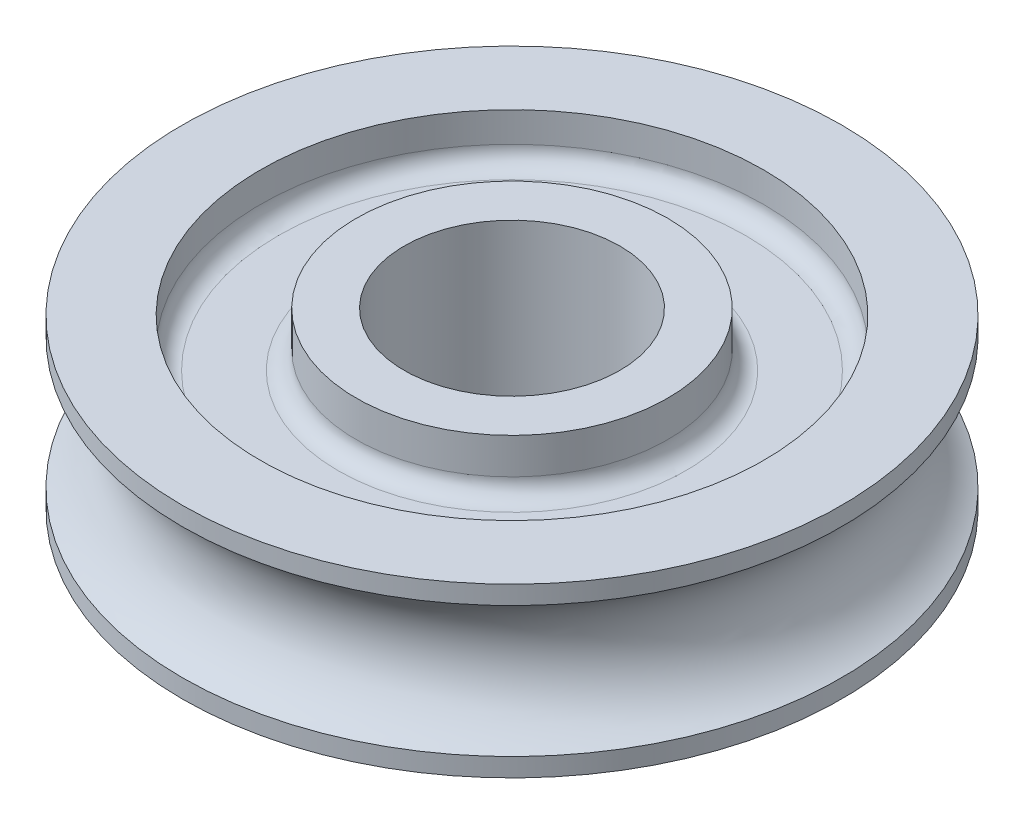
ISO-10303-21;
HEADER;
FILE_DESCRIPTION(('STEP AP214'),'2;1');
FILE_NAME('part.step','',(''),(''),'','','');
FILE_SCHEMA(('AUTOMOTIVE_DESIGN { 1 0 10303 214 1 1 1 1 }'));
ENDSEC;
DATA;
#1=APPLICATION_CONTEXT('core data for automotive mechanical design processes');
#2=APPLICATION_PROTOCOL_DEFINITION('international standard','automotive_design',2000,#1);
#3=PRODUCT_CONTEXT('',#1,'mechanical');
#4=PRODUCT('Part','Part','',(#3));
#5=PRODUCT_RELATED_PRODUCT_CATEGORY('part','',(#4));
#6=PRODUCT_DEFINITION_FORMATION('','',#4);
#7=PRODUCT_DEFINITION_CONTEXT('part definition',#1,'design');
#8=PRODUCT_DEFINITION('design','',#6,#7);
#9=PRODUCT_DEFINITION_SHAPE('','',#8);
#10=(LENGTH_UNIT() NAMED_UNIT(*) SI_UNIT(.MILLI.,.METRE.));
#11=(NAMED_UNIT(*) PLANE_ANGLE_UNIT() SI_UNIT($,.RADIAN.));
#12=(NAMED_UNIT(*) SI_UNIT($,.STERADIAN.) SOLID_ANGLE_UNIT());
#13=UNCERTAINTY_MEASURE_WITH_UNIT(LENGTH_MEASURE(1.E-05),#10,'distance_accuracy_value','');
#14=(GEOMETRIC_REPRESENTATION_CONTEXT(3) GLOBAL_UNCERTAINTY_ASSIGNED_CONTEXT((#13)) GLOBAL_UNIT_ASSIGNED_CONTEXT((#10,
#11,#12)) REPRESENTATION_CONTEXT('',''));
#15=CARTESIAN_POINT('',(0.,0.,0.));
#16=DIRECTION('',(0.,0.,1.));
#17=DIRECTION('',(1.,0.,0.));
#18=AXIS2_PLACEMENT_3D('',#15,#16,#17);
#19=CARTESIAN_POINT('',(0.,-31.9033420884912,0.));
#20=DIRECTION('',(0.,-1.,0.));
#21=DIRECTION('',(0.,0.,-1.));
#22=AXIS2_PLACEMENT_3D('',#19,#20,#21);
#23=CYLINDRICAL_SURFACE('',#22,18.00000266);
#24=CARTESIAN_POINT('',(0.,15.,0.));
#25=DIRECTION('',(0.,-1.,0.));
#26=DIRECTION('',(0.,0.,-1.));
#27=AXIS2_PLACEMENT_3D('',#24,#25,#26);
#28=CIRCLE('',#27,18.00000266);
#29=CARTESIAN_POINT('',(0.,15.,-18.00000266));
#30=VERTEX_POINT('',#29);
#31=EDGE_CURVE('E10',#30,#30,#28,.T.);
#32=ORIENTED_EDGE('',*,*,#31,.F.);
#33=EDGE_LOOP('',(#32));
#34=FACE_BOUND('',#33,.T.);
#35=CARTESIAN_POINT('',(0.,-15.,0.));
#36=DIRECTION('',(0.,-1.,0.));
#37=DIRECTION('',(0.,0.,-1.));
#38=AXIS2_PLACEMENT_3D('',#35,#36,#37);
#39=CIRCLE('',#38,18.00000266);
#40=CARTESIAN_POINT('',(0.,-15.,-18.00000266));
#41=VERTEX_POINT('',#40);
#42=EDGE_CURVE('E82',#41,#41,#39,.T.);
#43=ORIENTED_EDGE('',*,*,#42,.T.);
#44=EDGE_LOOP('',(#43));
#45=FACE_BOUND('',#44,.T.);
#46=ADVANCED_FACE('F24',(#34,#45),#23,.F.);
#47=CARTESIAN_POINT('',(-18.00000266,15.,0.));
#48=DIRECTION('',(0.,-1.,0.));
#49=DIRECTION('',(0.,0.,-1.));
#50=AXIS2_PLACEMENT_3D('',#47,#48,#49);
#51=PLANE('',#50);
#52=CARTESIAN_POINT('',(0.,15.,0.));
#53=DIRECTION('',(0.,-1.,0.));
#54=DIRECTION('',(0.,0.,-1.));
#55=AXIS2_PLACEMENT_3D('',#52,#53,#54);
#56=CIRCLE('',#55,26.00000266);
#57=CARTESIAN_POINT('',(0.,15.,-26.00000266));
#58=VERTEX_POINT('',#57);
#59=EDGE_CURVE('E30',#58,#58,#56,.T.);
#60=ORIENTED_EDGE('',*,*,#59,.F.);
#61=EDGE_LOOP('',(#60));
#62=FACE_BOUND('',#61,.T.);
#63=ORIENTED_EDGE('',*,*,#31,.T.);
#64=EDGE_LOOP('',(#63));
#65=FACE_BOUND('',#64,.T.);
#66=ADVANCED_FACE('F179',(#62,#65),#51,.F.);
#67=CARTESIAN_POINT('',(0.,-31.9033420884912,0.));
#68=DIRECTION('',(0.,-1.,0.));
#69=DIRECTION('',(0.,0.,-1.));
#70=AXIS2_PLACEMENT_3D('',#67,#68,#69);
#71=CYLINDRICAL_SURFACE('',#70,26.00000266);
#72=CARTESIAN_POINT('',(0.,9.00000000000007,0.));
#73=DIRECTION('',(0.,-1.,0.));
#74=DIRECTION('',(0.,0.,-1.));
#75=AXIS2_PLACEMENT_3D('',#72,#73,#74);
#76=CIRCLE('',#75,26.00000266);
#77=CARTESIAN_POINT('',(0.,9.00000000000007,-26.00000266));
#78=VERTEX_POINT('',#77);
#79=EDGE_CURVE('E34',#78,#78,#76,.T.);
#80=ORIENTED_EDGE('',*,*,#79,.F.);
#81=EDGE_LOOP('',(#80));
#82=FACE_BOUND('',#81,.T.);
#83=ORIENTED_EDGE('',*,*,#59,.T.);
#84=EDGE_LOOP('',(#83));
#85=FACE_BOUND('',#84,.T.);
#86=ADVANCED_FACE('F174',(#82,#85),#71,.T.);
#87=CARTESIAN_POINT('',(0.,9.00000000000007,0.));
#88=DIRECTION('',(0.,-1.,0.));
#89=DIRECTION('',(0.,0.,-1.));
#90=AXIS2_PLACEMENT_3D('',#87,#88,#89);
#91=TOROIDAL_SURFACE('',#90,29.00000266,3.);
#92=CARTESIAN_POINT('',(0.,6.00000000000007,0.));
#93=DIRECTION('',(0.,-1.,0.));
#94=DIRECTION('',(0.,0.,-1.));
#95=AXIS2_PLACEMENT_3D('',#92,#93,#94);
#96=CIRCLE('',#95,29.00000266);
#97=CARTESIAN_POINT('',(0.,6.00000000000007,-29.00000266));
#98=VERTEX_POINT('',#97);
#99=EDGE_CURVE('E38',#98,#98,#96,.T.);
#100=ORIENTED_EDGE('',*,*,#99,.F.);
#101=EDGE_LOOP('',(#100));
#102=FACE_BOUND('',#101,.T.);
#103=ORIENTED_EDGE('',*,*,#79,.T.);
#104=EDGE_LOOP('',(#103));
#105=FACE_BOUND('',#104,.T.);
#106=ADVANCED_FACE('F168',(#102,#105),#91,.F.);
#107=CARTESIAN_POINT('',(-29.00000266,6.00000000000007,0.));
#108=DIRECTION('',(0.,-1.,0.));
#109=DIRECTION('',(0.,0.,-1.));
#110=AXIS2_PLACEMENT_3D('',#107,#108,#109);
#111=PLANE('',#110);
#112=CARTESIAN_POINT('',(0.,6.00000000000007,0.));
#113=DIRECTION('',(0.,-1.,0.));
#114=DIRECTION('',(0.,0.,-1.));
#115=AXIS2_PLACEMENT_3D('',#112,#113,#114);
#116=CIRCLE('',#115,39.00000266);
#117=CARTESIAN_POINT('',(0.,6.00000000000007,-39.00000266));
#118=VERTEX_POINT('',#117);
#119=EDGE_CURVE('E43',#118,#118,#116,.T.);
#120=ORIENTED_EDGE('',*,*,#119,.F.);
#121=EDGE_LOOP('',(#120));
#122=FACE_BOUND('',#121,.T.);
#123=ORIENTED_EDGE('',*,*,#99,.T.);
#124=EDGE_LOOP('',(#123));
#125=FACE_BOUND('',#124,.T.);
#126=ADVANCED_FACE('F162',(#122,#125),#111,.F.);
#127=CARTESIAN_POINT('',(0.,9.00000000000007,0.));
#128=DIRECTION('',(0.,-1.,0.));
#129=DIRECTION('',(0.,0.,-1.));
#130=AXIS2_PLACEMENT_3D('',#127,#128,#129);
#131=TOROIDAL_SURFACE('',#130,39.00000266,3.);
#132=CARTESIAN_POINT('',(0.,9.00000000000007,0.));
#133=DIRECTION('',(0.,-1.,0.));
#134=DIRECTION('',(0.,0.,-1.));
#135=AXIS2_PLACEMENT_3D('',#132,#133,#134);
#136=CIRCLE('',#135,42.00000266);
#137=CARTESIAN_POINT('',(0.,9.00000000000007,-42.00000266));
#138=VERTEX_POINT('',#137);
#139=EDGE_CURVE('E46',#138,#138,#136,.T.);
#140=ORIENTED_EDGE('',*,*,#139,.F.);
#141=EDGE_LOOP('',(#140));
#142=FACE_BOUND('',#141,.T.);
#143=ORIENTED_EDGE('',*,*,#119,.T.);
#144=EDGE_LOOP('',(#143));
#145=FACE_BOUND('',#144,.T.);
#146=ADVANCED_FACE('F156',(#142,#145),#131,.F.);
#147=CARTESIAN_POINT('',(0.,-31.9033420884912,0.));
#148=DIRECTION('',(0.,-1.,0.));
#149=DIRECTION('',(0.,0.,-1.));
#150=AXIS2_PLACEMENT_3D('',#147,#148,#149);
#151=CYLINDRICAL_SURFACE('',#150,42.00000266);
#152=CARTESIAN_POINT('',(0.,14.,0.));
#153=DIRECTION('',(0.,-1.,0.));
#154=DIRECTION('',(0.,0.,-1.));
#155=AXIS2_PLACEMENT_3D('',#152,#153,#154);
#156=CIRCLE('',#155,42.00000266);
#157=CARTESIAN_POINT('',(0.,14.,-42.00000266));
#158=VERTEX_POINT('',#157);
#159=EDGE_CURVE('E49',#158,#158,#156,.T.);
#160=ORIENTED_EDGE('',*,*,#159,.F.);
#161=EDGE_LOOP('',(#160));
#162=FACE_BOUND('',#161,.T.);
#163=ORIENTED_EDGE('',*,*,#139,.T.);
#164=EDGE_LOOP('',(#163));
#165=FACE_BOUND('',#164,.T.);
#166=ADVANCED_FACE('F150',(#162,#165),#151,.F.);
#167=CARTESIAN_POINT('',(-42.00000266,14.,0.));
#168=DIRECTION('',(0.,-1.,0.));
#169=DIRECTION('',(0.,0.,-1.));
#170=AXIS2_PLACEMENT_3D('',#167,#168,#169);
#171=PLANE('',#170);
#172=CARTESIAN_POINT('',(0.,14.,0.));
#173=DIRECTION('',(0.,-1.,0.));
#174=DIRECTION('',(0.,0.,-1.));
#175=AXIS2_PLACEMENT_3D('',#172,#173,#174);
#176=CIRCLE('',#175,55.);
#177=CARTESIAN_POINT('',(0.,14.,-55.));
#178=VERTEX_POINT('',#177);
#179=EDGE_CURVE('E52',#178,#178,#176,.T.);
#180=ORIENTED_EDGE('',*,*,#179,.F.);
#181=EDGE_LOOP('',(#180));
#182=FACE_BOUND('',#181,.T.);
#183=ORIENTED_EDGE('',*,*,#159,.T.);
#184=EDGE_LOOP('',(#183));
#185=FACE_BOUND('',#184,.T.);
#186=ADVANCED_FACE('F144',(#182,#185),#171,.F.);
#187=CARTESIAN_POINT('',(0.,-31.9033420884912,0.));
#188=DIRECTION('',(0.,-1.,0.));
#189=DIRECTION('',(0.,0.,-1.));
#190=AXIS2_PLACEMENT_3D('',#187,#188,#189);
#191=CYLINDRICAL_SURFACE('',#190,55.);
#192=CARTESIAN_POINT('',(0.,10.9087121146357,0.));
#193=DIRECTION('',(0.,-1.,0.));
#194=DIRECTION('',(0.,0.,-1.));
#195=AXIS2_PLACEMENT_3D('',#192,#193,#194);
#196=CIRCLE('',#195,55.);
#197=CARTESIAN_POINT('',(0.,10.9087121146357,-55.));
#198=VERTEX_POINT('',#197);
#199=EDGE_CURVE('E55',#198,#198,#196,.T.);
#200=ORIENTED_EDGE('',*,*,#199,.F.);
#201=EDGE_LOOP('',(#200));
#202=FACE_BOUND('',#201,.T.);
#203=ORIENTED_EDGE('',*,*,#179,.T.);
#204=EDGE_LOOP('',(#203));
#205=FACE_BOUND('',#204,.T.);
#206=ADVANCED_FACE('F138',(#202,#205),#191,.T.);
#207=CARTESIAN_POINT('',(0.,0.,0.));
#208=DIRECTION('',(0.,-1.,0.));
#209=DIRECTION('',(0.,0.,-1.));
#210=AXIS2_PLACEMENT_3D('',#207,#208,#209);
#211=TOROIDAL_SURFACE('',#210,60.,12.);
#212=CARTESIAN_POINT('',(0.,-10.9087121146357,0.));
#213=DIRECTION('',(0.,-1.,0.));
#214=DIRECTION('',(0.,0.,-1.));
#215=AXIS2_PLACEMENT_3D('',#212,#213,#214);
#216=CIRCLE('',#215,55.);
#217=CARTESIAN_POINT('',(0.,-10.9087121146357,-55.));
#218=VERTEX_POINT('',#217);
#219=EDGE_CURVE('E58',#218,#218,#216,.T.);
#220=ORIENTED_EDGE('',*,*,#219,.F.);
#221=EDGE_LOOP('',(#220));
#222=FACE_BOUND('',#221,.T.);
#223=ORIENTED_EDGE('',*,*,#199,.T.);
#224=EDGE_LOOP('',(#223));
#225=FACE_BOUND('',#224,.T.);
#226=ADVANCED_FACE('F132',(#222,#225),#211,.F.);
#227=CARTESIAN_POINT('',(0.,-31.9033420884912,0.));
#228=DIRECTION('',(0.,-1.,0.));
#229=DIRECTION('',(0.,0.,-1.));
#230=AXIS2_PLACEMENT_3D('',#227,#228,#229);
#231=CYLINDRICAL_SURFACE('',#230,55.);
#232=CARTESIAN_POINT('',(0.,-14.,0.));
#233=DIRECTION('',(0.,-1.,0.));
#234=DIRECTION('',(0.,0.,-1.));
#235=AXIS2_PLACEMENT_3D('',#232,#233,#234);
#236=CIRCLE('',#235,55.);
#237=CARTESIAN_POINT('',(0.,-14.,-55.));
#238=VERTEX_POINT('',#237);
#239=EDGE_CURVE('E61',#238,#238,#236,.T.);
#240=ORIENTED_EDGE('',*,*,#239,.F.);
#241=EDGE_LOOP('',(#240));
#242=FACE_BOUND('',#241,.T.);
#243=ORIENTED_EDGE('',*,*,#219,.T.);
#244=EDGE_LOOP('',(#243));
#245=FACE_BOUND('',#244,.T.);
#246=ADVANCED_FACE('F126',(#242,#245),#231,.T.);
#247=CARTESIAN_POINT('',(-42.00000266,-14.,0.));
#248=DIRECTION('',(0.,1.,0.));
#249=DIRECTION('',(0.,0.,1.));
#250=AXIS2_PLACEMENT_3D('',#247,#248,#249);
#251=PLANE('',#250);
#252=CARTESIAN_POINT('',(0.,-14.,0.));
#253=DIRECTION('',(0.,-1.,0.));
#254=DIRECTION('',(0.,0.,-1.));
#255=AXIS2_PLACEMENT_3D('',#252,#253,#254);
#256=CIRCLE('',#255,42.00000266);
#257=CARTESIAN_POINT('',(0.,-14.,-42.00000266));
#258=VERTEX_POINT('',#257);
#259=EDGE_CURVE('E64',#258,#258,#256,.T.);
#260=ORIENTED_EDGE('',*,*,#259,.F.);
#261=EDGE_LOOP('',(#260));
#262=FACE_BOUND('',#261,.T.);
#263=ORIENTED_EDGE('',*,*,#239,.T.);
#264=EDGE_LOOP('',(#263));
#265=FACE_BOUND('',#264,.T.);
#266=ADVANCED_FACE('F120',(#262,#265),#251,.F.);
#267=CARTESIAN_POINT('',(0.,-31.9033420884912,0.));
#268=DIRECTION('',(0.,-1.,0.));
#269=DIRECTION('',(0.,0.,-1.));
#270=AXIS2_PLACEMENT_3D('',#267,#268,#269);
#271=CYLINDRICAL_SURFACE('',#270,42.00000266);
#272=CARTESIAN_POINT('',(0.,-9.00000000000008,0.));
#273=DIRECTION('',(0.,-1.,0.));
#274=DIRECTION('',(0.,0.,-1.));
#275=AXIS2_PLACEMENT_3D('',#272,#273,#274);
#276=CIRCLE('',#275,42.00000266);
#277=CARTESIAN_POINT('',(0.,-9.00000000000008,-42.00000266));
#278=VERTEX_POINT('',#277);
#279=EDGE_CURVE('E67',#278,#278,#276,.T.);
#280=ORIENTED_EDGE('',*,*,#279,.F.);
#281=EDGE_LOOP('',(#280));
#282=FACE_BOUND('',#281,.T.);
#283=ORIENTED_EDGE('',*,*,#259,.T.);
#284=EDGE_LOOP('',(#283));
#285=FACE_BOUND('',#284,.T.);
#286=ADVANCED_FACE('F114',(#282,#285),#271,.F.);
#287=CARTESIAN_POINT('',(0.,-9.00000000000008,0.));
#288=DIRECTION('',(0.,-1.,0.));
#289=DIRECTION('',(0.,0.,-1.));
#290=AXIS2_PLACEMENT_3D('',#287,#288,#289);
#291=TOROIDAL_SURFACE('',#290,39.00000266,3.);
#292=CARTESIAN_POINT('',(0.,-6.00000000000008,0.));
#293=DIRECTION('',(0.,-1.,0.));
#294=DIRECTION('',(0.,0.,-1.));
#295=AXIS2_PLACEMENT_3D('',#292,#293,#294);
#296=CIRCLE('',#295,39.00000266);
#297=CARTESIAN_POINT('',(0.,-6.00000000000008,-39.00000266));
#298=VERTEX_POINT('',#297);
#299=EDGE_CURVE('E70',#298,#298,#296,.T.);
#300=ORIENTED_EDGE('',*,*,#299,.F.);
#301=EDGE_LOOP('',(#300));
#302=FACE_BOUND('',#301,.T.);
#303=ORIENTED_EDGE('',*,*,#279,.T.);
#304=EDGE_LOOP('',(#303));
#305=FACE_BOUND('',#304,.T.);
#306=ADVANCED_FACE('F108',(#302,#305),#291,.F.);
#307=CARTESIAN_POINT('',(-29.00000266,-6.00000000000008,0.));
#308=DIRECTION('',(0.,1.,0.));
#309=DIRECTION('',(0.,0.,1.));
#310=AXIS2_PLACEMENT_3D('',#307,#308,#309);
#311=PLANE('',#310);
#312=CARTESIAN_POINT('',(0.,-6.00000000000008,0.));
#313=DIRECTION('',(0.,-1.,0.));
#314=DIRECTION('',(0.,0.,-1.));
#315=AXIS2_PLACEMENT_3D('',#312,#313,#314);
#316=CIRCLE('',#315,29.00000266);
#317=CARTESIAN_POINT('',(0.,-6.00000000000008,-29.00000266));
#318=VERTEX_POINT('',#317);
#319=EDGE_CURVE('E73',#318,#318,#316,.T.);
#320=ORIENTED_EDGE('',*,*,#319,.F.);
#321=EDGE_LOOP('',(#320));
#322=FACE_BOUND('',#321,.T.);
#323=ORIENTED_EDGE('',*,*,#299,.T.);
#324=EDGE_LOOP('',(#323));
#325=FACE_BOUND('',#324,.T.);
#326=ADVANCED_FACE('F102',(#322,#325),#311,.F.);
#327=CARTESIAN_POINT('',(0.,-9.00000000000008,0.));
#328=DIRECTION('',(0.,-1.,0.));
#329=DIRECTION('',(0.,0.,-1.));
#330=AXIS2_PLACEMENT_3D('',#327,#328,#329);
#331=TOROIDAL_SURFACE('',#330,29.00000266,3.);
#332=CARTESIAN_POINT('',(0.,-9.00000000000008,0.));
#333=DIRECTION('',(0.,-1.,0.));
#334=DIRECTION('',(0.,0.,-1.));
#335=AXIS2_PLACEMENT_3D('',#332,#333,#334);
#336=CIRCLE('',#335,26.00000266);
#337=CARTESIAN_POINT('',(0.,-9.00000000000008,-26.00000266));
#338=VERTEX_POINT('',#337);
#339=EDGE_CURVE('E76',#338,#338,#336,.T.);
#340=ORIENTED_EDGE('',*,*,#339,.F.);
#341=EDGE_LOOP('',(#340));
#342=FACE_BOUND('',#341,.T.);
#343=ORIENTED_EDGE('',*,*,#319,.T.);
#344=EDGE_LOOP('',(#343));
#345=FACE_BOUND('',#344,.T.);
#346=ADVANCED_FACE('F96',(#342,#345),#331,.F.);
#347=CARTESIAN_POINT('',(0.,-31.9033420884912,0.));
#348=DIRECTION('',(0.,-1.,0.));
#349=DIRECTION('',(0.,0.,-1.));
#350=AXIS2_PLACEMENT_3D('',#347,#348,#349);
#351=CYLINDRICAL_SURFACE('',#350,26.00000266);
#352=CARTESIAN_POINT('',(0.,-15.,0.));
#353=DIRECTION('',(0.,-1.,0.));
#354=DIRECTION('',(0.,0.,-1.));
#355=AXIS2_PLACEMENT_3D('',#352,#353,#354);
#356=CIRCLE('',#355,26.00000266);
#357=CARTESIAN_POINT('',(0.,-15.,-26.00000266));
#358=VERTEX_POINT('',#357);
#359=EDGE_CURVE('E79',#358,#358,#356,.T.);
#360=ORIENTED_EDGE('',*,*,#359,.F.);
#361=EDGE_LOOP('',(#360));
#362=FACE_BOUND('',#361,.T.);
#363=ORIENTED_EDGE('',*,*,#339,.T.);
#364=EDGE_LOOP('',(#363));
#365=FACE_BOUND('',#364,.T.);
#366=ADVANCED_FACE('F90',(#362,#365),#351,.T.);
#367=CARTESIAN_POINT('',(-18.00000266,-15.,0.));
#368=DIRECTION('',(0.,1.,0.));
#369=DIRECTION('',(0.,0.,1.));
#370=AXIS2_PLACEMENT_3D('',#367,#368,#369);
#371=PLANE('',#370);
#372=ORIENTED_EDGE('',*,*,#42,.F.);
#373=EDGE_LOOP('',(#372));
#374=FACE_BOUND('',#373,.T.);
#375=ORIENTED_EDGE('',*,*,#359,.T.);
#376=EDGE_LOOP('',(#375));
#377=FACE_BOUND('',#376,.T.);
#378=ADVANCED_FACE('F87',(#374,#377),#371,.F.);
#379=CLOSED_SHELL('',(#46,#66,#86,#106,#126,#146,#166,#186,#206,#226,#246,#266,#286,#306,#326,
#346,#366,#378));
#380=MANIFOLD_SOLID_BREP('B2',#379);
#381=ADVANCED_BREP_SHAPE_REPRESENTATION('',(#18,#380),#14);
#382=SHAPE_DEFINITION_REPRESENTATION(#9,#381);
ENDSEC;
END-ISO-10303-21;
